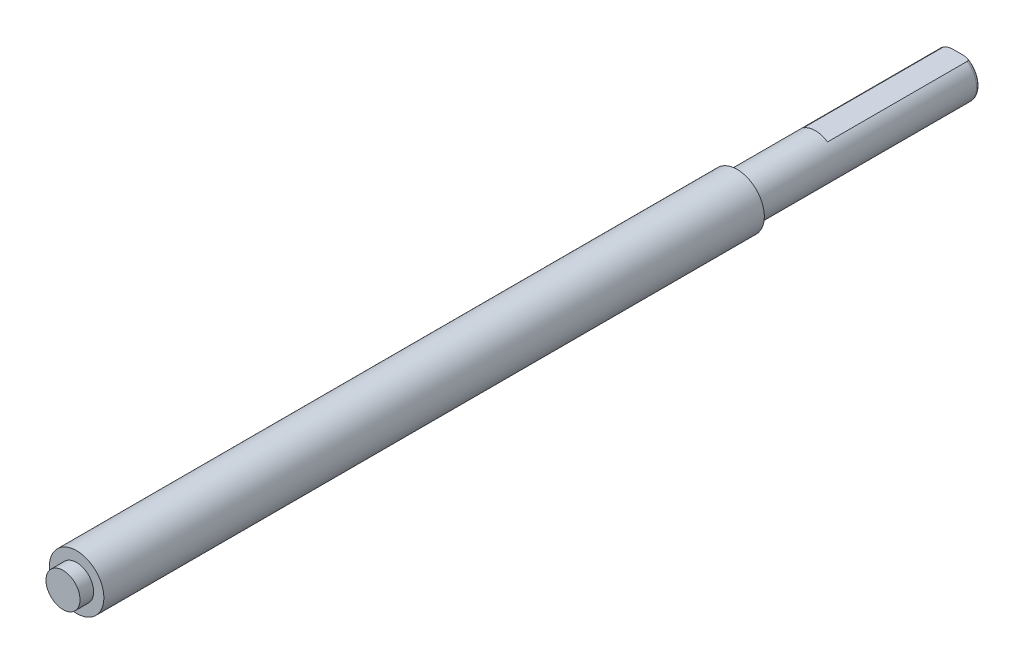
ISO-10303-21;
HEADER;
FILE_DESCRIPTION(('STEP AP214'),'2;1');
FILE_NAME('part.step','',(''),(''),'','','');
FILE_SCHEMA(('AUTOMOTIVE_DESIGN { 1 0 10303 214 1 1 1 1 }'));
ENDSEC;
DATA;
#1=APPLICATION_CONTEXT('core data for automotive mechanical design processes');
#2=APPLICATION_PROTOCOL_DEFINITION('international standard','automotive_design',2000,#1);
#3=PRODUCT_CONTEXT('',#1,'mechanical');
#4=PRODUCT('Part','Part','',(#3));
#5=PRODUCT_RELATED_PRODUCT_CATEGORY('part','',(#4));
#6=PRODUCT_DEFINITION_FORMATION('','',#4);
#7=PRODUCT_DEFINITION_CONTEXT('part definition',#1,'design');
#8=PRODUCT_DEFINITION('design','',#6,#7);
#9=PRODUCT_DEFINITION_SHAPE('','',#8);
#10=(LENGTH_UNIT() NAMED_UNIT(*) SI_UNIT(.MILLI.,.METRE.));
#11=(NAMED_UNIT(*) PLANE_ANGLE_UNIT() SI_UNIT($,.RADIAN.));
#12=(NAMED_UNIT(*) SI_UNIT($,.STERADIAN.) SOLID_ANGLE_UNIT());
#13=UNCERTAINTY_MEASURE_WITH_UNIT(LENGTH_MEASURE(1.E-05),#10,'distance_accuracy_value','');
#14=(GEOMETRIC_REPRESENTATION_CONTEXT(3) GLOBAL_UNCERTAINTY_ASSIGNED_CONTEXT((#13)) GLOBAL_UNIT_ASSIGNED_CONTEXT((#10,
#11,#12)) REPRESENTATION_CONTEXT('',''));
#15=CARTESIAN_POINT('',(0.,0.,0.));
#16=DIRECTION('',(0.,0.,1.));
#17=DIRECTION('',(1.,0.,0.));
#18=AXIS2_PLACEMENT_3D('',#15,#16,#17);
#19=CARTESIAN_POINT('',(0.,0.,129.5));
#20=DIRECTION('',(0.,0.,1.));
#21=DIRECTION('',(1.,0.,0.));
#22=AXIS2_PLACEMENT_3D('',#19,#20,#21);
#23=PLANE('',#22);
#24=CARTESIAN_POINT('',(0.,0.,129.5));
#25=DIRECTION('',(0.,0.,1.));
#26=DIRECTION('',(1.,0.,0.));
#27=AXIS2_PLACEMENT_3D('',#24,#25,#26);
#28=CIRCLE('',#27,4.);
#29=CARTESIAN_POINT('',(-4.,0.,129.5));
#30=VERTEX_POINT('',#29);
#31=EDGE_CURVE('E88',#30,#30,#28,.T.);
#32=ORIENTED_EDGE('',*,*,#31,.T.);
#33=EDGE_LOOP('',(#32));
#34=FACE_BOUND('',#33,.T.);
#35=CARTESIAN_POINT('',(0.,0.,129.5));
#36=DIRECTION('',(0.,0.,1.));
#37=DIRECTION('',(1.,0.,0.));
#38=AXIS2_PLACEMENT_3D('',#35,#36,#37);
#39=CIRCLE('',#38,2.5);
#40=CARTESIAN_POINT('',(2.5,0.,129.5));
#41=VERTEX_POINT('',#40);
#42=EDGE_CURVE('E201',#41,#41,#39,.T.);
#43=ORIENTED_EDGE('',*,*,#42,.F.);
#44=EDGE_LOOP('',(#43));
#45=FACE_BOUND('',#44,.T.);
#46=ADVANCED_FACE('F33',(#34,#45),#23,.T.);
#47=CARTESIAN_POINT('',(0.,0.,32.5));
#48=DIRECTION('',(0.,0.,-1.));
#49=DIRECTION('',(-1.,0.,0.));
#50=AXIS2_PLACEMENT_3D('',#47,#48,#49);
#51=CYLINDRICAL_SURFACE('',#50,3.175);
#52=CARTESIAN_POINT('',(0.,0.,32.5));
#53=DIRECTION('',(0.,0.,1.));
#54=DIRECTION('',(1.,0.,0.));
#55=AXIS2_PLACEMENT_3D('',#52,#53,#54);
#56=CIRCLE('',#55,3.175);
#57=CARTESIAN_POINT('',(3.175,0.,32.5));
#58=VERTEX_POINT('',#57);
#59=EDGE_CURVE('E91',#58,#58,#56,.T.);
#60=ORIENTED_EDGE('',*,*,#59,.F.);
#61=EDGE_LOOP('',(#60));
#62=FACE_BOUND('',#61,.T.);
#63=DIRECTION('',(0.,0.,-1.));
#64=VECTOR('',#63,1.);
#65=CARTESIAN_POINT('',(-1.78605710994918,2.625,21.));
#66=LINE('',#65,#64);
#67=CARTESIAN_POINT('',(-1.78605710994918,2.625,21.));
#68=VERTEX_POINT('',#67);
#69=CARTESIAN_POINT('',(-1.78605710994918,2.625,0.500000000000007));
#70=VERTEX_POINT('',#69);
#71=EDGE_CURVE('E77',#68,#70,#66,.T.);
#72=ORIENTED_EDGE('',*,*,#71,.T.);
#73=CARTESIAN_POINT('',(0.,0.,0.5));
#74=DIRECTION('',(0.,0.,1.));
#75=DIRECTION('',(1.,0.,0.));
#76=AXIS2_PLACEMENT_3D('',#73,#74,#75);
#77=CIRCLE('',#76,3.175);
#78=CARTESIAN_POINT('',(1.78605710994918,2.625,0.500000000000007));
#79=VERTEX_POINT('',#78);
#80=EDGE_CURVE('E82',#70,#79,#77,.T.);
#81=ORIENTED_EDGE('',*,*,#80,.T.);
#82=DIRECTION('',(0.,0.,-1.));
#83=VECTOR('',#82,1.);
#84=CARTESIAN_POINT('',(1.78605710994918,2.625,21.));
#85=LINE('',#84,#83);
#86=CARTESIAN_POINT('',(1.78605710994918,2.625,21.));
#87=VERTEX_POINT('',#86);
#88=EDGE_CURVE('E76',#87,#79,#85,.T.);
#89=ORIENTED_EDGE('',*,*,#88,.F.);
#90=CARTESIAN_POINT('',(0.,0.,21.));
#91=DIRECTION('',(0.,0.,-1.));
#92=DIRECTION('',(-1.,0.,0.));
#93=AXIS2_PLACEMENT_3D('',#90,#91,#92);
#94=CIRCLE('',#93,3.175);
#95=EDGE_CURVE('E66',#68,#87,#94,.T.);
#96=ORIENTED_EDGE('',*,*,#95,.F.);
#97=EDGE_LOOP('',(#72,#81,#89,#96));
#98=FACE_BOUND('',#97,.T.);
#99=ADVANCED_FACE('F80',(#62,#98),#51,.T.);
#100=CARTESIAN_POINT('',(0.,0.,0.));
#101=DIRECTION('',(0.,0.,1.));
#102=DIRECTION('',(1.,0.,0.));
#103=AXIS2_PLACEMENT_3D('',#100,#101,#102);
#104=PLANE('',#103);
#105=DIRECTION('',(-1.,0.,0.));
#106=VECTOR('',#105,1.);
#107=CARTESIAN_POINT('',(1.78605710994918,2.625,0.));
#108=LINE('',#107,#106);
#109=CARTESIAN_POINT('',(0.514781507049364,2.625,0.));
#110=VERTEX_POINT('',#109);
#111=CARTESIAN_POINT('',(-0.514781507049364,2.625,0.));
#112=VERTEX_POINT('',#111);
#113=EDGE_CURVE('E73',#110,#112,#108,.T.);
#114=ORIENTED_EDGE('',*,*,#113,.F.);
#115=CARTESIAN_POINT('',(0.,0.,0.));
#116=DIRECTION('',(0.,0.,1.));
#117=DIRECTION('',(1.,0.,0.));
#118=AXIS2_PLACEMENT_3D('',#115,#116,#117);
#119=CIRCLE('',#118,2.675);
#120=EDGE_CURVE('E11',#110,#112,#119,.F.);
#121=ORIENTED_EDGE('',*,*,#120,.T.);
#122=EDGE_LOOP('',(#114,#121));
#123=FACE_BOUND('',#122,.T.);
#124=ADVANCED_FACE('F118',(#123),#104,.F.);
#125=CARTESIAN_POINT('',(0.,0.,32.5));
#126=DIRECTION('',(0.,0.,1.));
#127=DIRECTION('',(1.,0.,0.));
#128=AXIS2_PLACEMENT_3D('',#125,#126,#127);
#129=PLANE('',#128);
#130=CARTESIAN_POINT('',(0.,0.,32.5));
#131=DIRECTION('',(0.,0.,1.));
#132=DIRECTION('',(1.,0.,0.));
#133=AXIS2_PLACEMENT_3D('',#130,#131,#132);
#134=CIRCLE('',#133,4.);
#135=CARTESIAN_POINT('',(-4.,0.,32.5));
#136=VERTEX_POINT('',#135);
#137=EDGE_CURVE('E84',#136,#136,#134,.T.);
#138=ORIENTED_EDGE('',*,*,#137,.F.);
#139=EDGE_LOOP('',(#138));
#140=FACE_BOUND('',#139,.T.);
#141=ORIENTED_EDGE('',*,*,#59,.T.);
#142=EDGE_LOOP('',(#141));
#143=FACE_BOUND('',#142,.T.);
#144=ADVANCED_FACE('F115',(#140,#143),#129,.F.);
#145=CARTESIAN_POINT('',(0.,0.,129.5));
#146=DIRECTION('',(0.,0.,-1.));
#147=DIRECTION('',(-1.,0.,0.));
#148=AXIS2_PLACEMENT_3D('',#145,#146,#147);
#149=CYLINDRICAL_SURFACE('',#148,4.);
#150=CARTESIAN_POINT('',(-4.,0.,129.5));
#151=CARTESIAN_POINT('',(-4.,0.,128.489583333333));
#152=CARTESIAN_POINT('',(-4.,0.,127.479166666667));
#153=CARTESIAN_POINT('',(-4.,0.,125.458333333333));
#154=CARTESIAN_POINT('',(-4.,0.,124.447916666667));
#155=CARTESIAN_POINT('',(-4.,0.,122.427083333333));
#156=CARTESIAN_POINT('',(-4.,0.,121.416666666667));
#157=CARTESIAN_POINT('',(-4.,0.,119.395833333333));
#158=CARTESIAN_POINT('',(-4.,0.,118.385416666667));
#159=CARTESIAN_POINT('',(-4.,0.,116.364583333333));
#160=CARTESIAN_POINT('',(-4.,0.,115.354166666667));
#161=CARTESIAN_POINT('',(-4.,0.,113.333333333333));
#162=CARTESIAN_POINT('',(-4.,0.,112.322916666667));
#163=CARTESIAN_POINT('',(-4.,0.,110.302083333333));
#164=CARTESIAN_POINT('',(-4.,0.,109.291666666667));
#165=CARTESIAN_POINT('',(-4.,0.,107.270833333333));
#166=CARTESIAN_POINT('',(-4.,0.,106.260416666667));
#167=CARTESIAN_POINT('',(-4.,0.,104.239583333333));
#168=CARTESIAN_POINT('',(-4.,0.,103.229166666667));
#169=CARTESIAN_POINT('',(-4.,0.,101.208333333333));
#170=CARTESIAN_POINT('',(-4.,0.,100.197916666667));
#171=CARTESIAN_POINT('',(-4.,0.,98.1770833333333));
#172=CARTESIAN_POINT('',(-4.,0.,97.1666666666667));
#173=CARTESIAN_POINT('',(-4.,0.,95.1458333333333));
#174=CARTESIAN_POINT('',(-4.,0.,94.1354166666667));
#175=CARTESIAN_POINT('',(-4.,0.,92.1145833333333));
#176=CARTESIAN_POINT('',(-4.,0.,91.1041666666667));
#177=CARTESIAN_POINT('',(-4.,0.,89.0833333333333));
#178=CARTESIAN_POINT('',(-4.,0.,88.0729166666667));
#179=CARTESIAN_POINT('',(-4.,0.,86.0520833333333));
#180=CARTESIAN_POINT('',(-4.,0.,85.0416666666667));
#181=CARTESIAN_POINT('',(-4.,0.,83.0208333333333));
#182=CARTESIAN_POINT('',(-4.,0.,82.0104166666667));
#183=CARTESIAN_POINT('',(-4.,0.,79.9895833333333));
#184=CARTESIAN_POINT('',(-4.,0.,78.9791666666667));
#185=CARTESIAN_POINT('',(-4.,0.,76.9583333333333));
#186=CARTESIAN_POINT('',(-4.,0.,75.9479166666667));
#187=CARTESIAN_POINT('',(-4.,0.,73.9270833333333));
#188=CARTESIAN_POINT('',(-4.,0.,72.9166666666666));
#189=CARTESIAN_POINT('',(-4.,0.,70.8958333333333));
#190=CARTESIAN_POINT('',(-4.,0.,69.8854166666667));
#191=CARTESIAN_POINT('',(-4.,0.,67.8645833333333));
#192=CARTESIAN_POINT('',(-4.,0.,66.8541666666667));
#193=CARTESIAN_POINT('',(-4.,0.,64.8333333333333));
#194=CARTESIAN_POINT('',(-4.,0.,63.8229166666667));
#195=CARTESIAN_POINT('',(-4.,0.,61.8020833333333));
#196=CARTESIAN_POINT('',(-4.,0.,60.7916666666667));
#197=CARTESIAN_POINT('',(-4.,0.,58.7708333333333));
#198=CARTESIAN_POINT('',(-4.,0.,57.7604166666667));
#199=CARTESIAN_POINT('',(-4.,0.,55.7395833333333));
#200=CARTESIAN_POINT('',(-4.,0.,54.7291666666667));
#201=CARTESIAN_POINT('',(-4.,0.,52.7083333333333));
#202=CARTESIAN_POINT('',(-4.,0.,51.6979166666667));
#203=CARTESIAN_POINT('',(-4.,0.,49.6770833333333));
#204=CARTESIAN_POINT('',(-4.,0.,48.6666666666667));
#205=CARTESIAN_POINT('',(-4.,0.,46.6458333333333));
#206=CARTESIAN_POINT('',(-4.,0.,45.6354166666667));
#207=CARTESIAN_POINT('',(-4.,0.,43.6145833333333));
#208=CARTESIAN_POINT('',(-4.,0.,42.6041666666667));
#209=CARTESIAN_POINT('',(-4.,0.,40.5833333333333));
#210=CARTESIAN_POINT('',(-4.,0.,39.5729166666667));
#211=CARTESIAN_POINT('',(-4.,0.,37.5520833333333));
#212=CARTESIAN_POINT('',(-4.,0.,36.5416666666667));
#213=CARTESIAN_POINT('',(-4.,0.,34.5208333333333));
#214=CARTESIAN_POINT('',(-4.,0.,33.5104166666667));
#215=CARTESIAN_POINT('',(-4.,0.,32.5));
#216=B_SPLINE_CURVE_WITH_KNOTS('',3,(#150,#151,#152,#153,#154,#155,#156,#157,#158,#159,#160,
#161,#162,#163,#164,#165,#166,#167,#168,#169,#170,#171,#172,#173,#174,#175,#176,#177,#178,#179,
#180,#181,#182,#183,#184,#185,#186,#187,#188,#189,#190,#191,#192,#193,#194,#195,#196,#197,#198,
#199,#200,#201,#202,#203,#204,#205,#206,#207,#208,#209,#210,#211,#212,#213,#214,#215),
.UNSPECIFIED.,.F.,.F.,(4,2,2,2,2,2,2,2,2,2,2,2,2,2,2,2,2,2,2,2,2,2,2,2,2,2,2,2,2,2,2,2,4),(0.,
3.03124999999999,6.06249999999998,9.09374999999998,12.125,15.15625,18.1875,21.21875,24.25,
27.28125,30.3125,33.34375,36.375,39.40625,42.4375,45.46875,48.5,51.53125,54.5625,57.59375,
60.625,63.65625,66.6875,69.71875,72.75,75.78125,78.8125,81.84375,84.875,87.90625,90.9375,
93.96875,97.),.UNSPECIFIED.);
#217=EDGE_CURVE('BSEAM109',#30,#136,#216,.T.);
#218=ORIENTED_EDGE('',*,*,#31,.F.);
#219=ORIENTED_EDGE('',*,*,#137,.T.);
#220=ORIENTED_EDGE('',*,*,#217,.T.);
#221=ORIENTED_EDGE('',*,*,#217,.F.);
#222=EDGE_LOOP('',(#218,#220,#219,#221));
#223=FACE_BOUND('',#222,.T.);
#224=ADVANCED_FACE('F109',(#223),#149,.T.);
#225=CARTESIAN_POINT('',(1.78605710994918,2.625,21.));
#226=DIRECTION('',(0.,-1.,0.));
#227=DIRECTION('',(0.,0.,-1.));
#228=AXIS2_PLACEMENT_3D('',#225,#226,#227);
#229=PLANE('',#228);
#230=ORIENTED_EDGE('',*,*,#88,.T.);
#231=CARTESIAN_POINT('',(1.78605710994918,2.625,0.5));
#232=CARTESIAN_POINT('',(1.7861183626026,2.625,0.480515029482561));
#233=CARTESIAN_POINT('',(1.78403706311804,2.625,0.461106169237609));
#234=CARTESIAN_POINT('',(1.77614566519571,2.625,0.423291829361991));
#235=CARTESIAN_POINT('',(1.77038040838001,2.625,0.404877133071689));
#236=CARTESIAN_POINT('',(1.75568721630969,2.625,0.369486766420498));
#237=CARTESIAN_POINT('',(1.74677356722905,2.625,0.352505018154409));
#238=CARTESIAN_POINT('',(1.72641804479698,2.625,0.320088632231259));
#239=CARTESIAN_POINT('',(1.71496821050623,2.625,0.304659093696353));
#240=CARTESIAN_POINT('',(1.68383170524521,2.625,0.26803343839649));
#241=CARTESIAN_POINT('',(1.66291485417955,2.625,0.247887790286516));
#242=CARTESIAN_POINT('',(1.61825721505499,2.625,0.211090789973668));
#243=CARTESIAN_POINT('',(1.59451232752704,2.625,0.194444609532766));
#244=CARTESIAN_POINT('',(1.52776741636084,2.625,0.153457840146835));
#245=CARTESIAN_POINT('',(1.48301267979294,2.625,0.131986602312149));
#246=CARTESIAN_POINT('',(1.41389871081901,2.625,0.104695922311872));
#247=CARTESIAN_POINT('',(1.39041958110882,2.625,0.0963921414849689));
#248=CARTESIAN_POINT('',(1.34299986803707,2.625,0.0812423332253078));
#249=CARTESIAN_POINT('',(1.31905952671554,2.625,0.074395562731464));
#250=CARTESIAN_POINT('',(1.23008070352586,2.625,0.0514093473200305));
#251=CARTESIAN_POINT('',(1.16404779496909,2.625,0.0391500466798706));
#252=CARTESIAN_POINT('',(1.03103589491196,2.625,0.0205768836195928));
#253=CARTESIAN_POINT('',(0.964054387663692,2.625,0.0142841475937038));
#254=CARTESIAN_POINT('',(0.833124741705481,2.625,0.00573297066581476));
#255=CARTESIAN_POINT('',(0.769187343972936,2.625,0.00329337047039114));
#256=CARTESIAN_POINT('',(0.67349457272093,2.625,0.0011481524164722));
#257=CARTESIAN_POINT('',(0.641749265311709,2.625,0.000684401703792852));
#258=CARTESIAN_POINT('',(0.578263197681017,2.625,0.000111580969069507));
#259=CARTESIAN_POINT('',(0.546522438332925,2.625,2.42149440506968E-06));
#260=CARTESIAN_POINT('',(0.514781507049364,2.625,0.));
#261=B_SPLINE_CURVE_WITH_KNOTS('',3,(#231,#232,#233,#234,#235,#236,#237,#238,#239,#240,#241,
#242,#243,#244,#245,#246,#247,#248,#249,#250,#251,#252,#253,#254,#255,#256,#257,#258,#259,#260),
.UNSPECIFIED.,.F.,.F.,(4,2,2,2,2,2,2,2,2,2,2,2,2,2,4),(0.,0.0582234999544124,0.115751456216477,
0.173021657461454,0.230474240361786,0.317101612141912,0.403856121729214,0.551884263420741,
0.62657755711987,0.701232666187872,0.90221485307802,1.10390604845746,1.29579765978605,
1.39104324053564,1.48626479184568),.UNSPECIFIED.);
#262=EDGE_CURVE('E42',#79,#110,#261,.T.);
#263=ORIENTED_EDGE('',*,*,#262,.T.);
#264=ORIENTED_EDGE('',*,*,#113,.T.);
#265=CARTESIAN_POINT('',(-0.514781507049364,2.625,0.));
#266=CARTESIAN_POINT('',(-0.545138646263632,2.625,1.99675866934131E-06));
#267=CARTESIAN_POINT('',(-0.575495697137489,2.625,0.00010207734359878));
#268=CARTESIAN_POINT('',(-0.63621318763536,2.625,0.000620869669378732));
#269=CARTESIAN_POINT('',(-0.666573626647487,2.625,0.00103964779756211));
#270=CARTESIAN_POINT('',(-0.757972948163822,2.625,0.00296465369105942));
#271=CARTESIAN_POINT('',(-0.819003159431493,2.625,0.00514219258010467));
#272=CARTESIAN_POINT('',(-0.941825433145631,2.625,0.0125778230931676));
#273=CARTESIAN_POINT('',(-1.00361494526,2.625,0.0178823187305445));
#274=CARTESIAN_POINT('',(-1.12651560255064,2.625,0.0332527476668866));
#275=CARTESIAN_POINT('',(-1.18762806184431,2.625,0.0433066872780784));
#276=CARTESIAN_POINT('',(-1.28243856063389,2.625,0.0645844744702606));
#277=CARTESIAN_POINT('',(-1.31665689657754,2.625,0.0734587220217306));
#278=CARTESIAN_POINT('',(-1.38423460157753,2.625,0.0940301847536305));
#279=CARTESIAN_POINT('',(-1.41759448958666,2.625,0.105725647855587));
#280=CARTESIAN_POINT('',(-1.48318231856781,2.625,0.132705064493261));
#281=CARTESIAN_POINT('',(-1.51539860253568,2.625,0.148017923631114));
#282=CARTESIAN_POINT('',(-1.57740901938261,2.625,0.182992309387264));
#283=CARTESIAN_POINT('',(-1.60720754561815,2.625,0.202645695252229));
#284=CARTESIAN_POINT('',(-1.65201841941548,2.625,0.238603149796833));
#285=CARTESIAN_POINT('',(-1.66831627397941,2.625,0.253297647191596));
#286=CARTESIAN_POINT('',(-1.69872512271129,2.625,0.28482495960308));
#287=CARTESIAN_POINT('',(-1.71283757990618,2.625,0.301656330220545));
#288=CARTESIAN_POINT('',(-1.73617877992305,2.625,0.334788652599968));
#289=CARTESIAN_POINT('',(-1.74582188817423,2.625,0.350794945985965));
#290=CARTESIAN_POINT('',(-1.76232487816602,2.625,0.38416491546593));
#291=CARTESIAN_POINT('',(-1.76919194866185,2.625,0.401524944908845));
#292=CARTESIAN_POINT('',(-1.77820439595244,2.625,0.432417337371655));
#293=CARTESIAN_POINT('',(-1.78112252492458,2.625,0.445725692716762));
#294=CARTESIAN_POINT('',(-1.78506131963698,2.625,0.472682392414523));
#295=CARTESIAN_POINT('',(-1.78607295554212,2.625,0.486332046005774));
#296=CARTESIAN_POINT('',(-1.78605710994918,2.625,0.500000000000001));
#297=B_SPLINE_CURVE_WITH_KNOTS('',3,(#265,#266,#267,#268,#269,#270,#271,#272,#273,#274,#275,
#276,#277,#278,#279,#280,#281,#282,#283,#284,#285,#286,#287,#288,#289,#290,#291,#292,#293,#294,
#295,#296),.UNSPECIFIED.,.F.,.F.,(4,2,2,2,2,2,2,2,2,2,2,2,2,2,2,4),(0.,0.091070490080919,
0.182159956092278,0.365318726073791,0.551266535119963,0.736747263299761,0.842706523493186,
0.948600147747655,1.05537040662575,1.16194209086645,1.22761113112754,1.2932360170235,
1.34908253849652,1.40478350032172,1.44552659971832,1.4864621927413),.UNSPECIFIED.);
#298=EDGE_CURVE('E97',#112,#70,#297,.T.);
#299=ORIENTED_EDGE('',*,*,#298,.T.);
#300=ORIENTED_EDGE('',*,*,#71,.F.);
#301=DIRECTION('',(-1.,0.,0.));
#302=VECTOR('',#301,1.);
#303=CARTESIAN_POINT('',(1.78605710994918,2.625,21.));
#304=LINE('',#303,#302);
#305=EDGE_CURVE('E69',#87,#68,#304,.T.);
#306=ORIENTED_EDGE('',*,*,#305,.F.);
#307=EDGE_LOOP('',(#230,#263,#264,#299,#300,#306));
#308=FACE_BOUND('',#307,.T.);
#309=ADVANCED_FACE('F75',(#308),#229,.F.);
#310=CARTESIAN_POINT('',(0.,0.,21.));
#311=DIRECTION('',(0.,0.,-1.));
#312=DIRECTION('',(-1.,0.,0.));
#313=AXIS2_PLACEMENT_3D('',#310,#311,#312);
#314=PLANE('',#313);
#315=ORIENTED_EDGE('',*,*,#95,.T.);
#316=ORIENTED_EDGE('',*,*,#305,.T.);
#317=EDGE_LOOP('',(#315,#316));
#318=FACE_BOUND('',#317,.T.);
#319=ADVANCED_FACE('F68',(#318),#314,.T.);
#320=CARTESIAN_POINT('',(0.,0.,0.5));
#321=DIRECTION('',(0.,0.,1.));
#322=DIRECTION('',(1.,0.,0.));
#323=AXIS2_PLACEMENT_3D('',#320,#321,#322);
#324=TOROIDAL_SURFACE('',#323,2.675,0.5);
#325=ORIENTED_EDGE('',*,*,#298,.F.);
#326=ORIENTED_EDGE('',*,*,#120,.F.);
#327=ORIENTED_EDGE('',*,*,#262,.F.);
#328=ORIENTED_EDGE('',*,*,#80,.F.);
#329=EDGE_LOOP('',(#325,#326,#327,#328));
#330=FACE_BOUND('',#329,.T.);
#331=ADVANCED_FACE('F35',(#330),#324,.T.);
#332=CARTESIAN_POINT('',(0.,0.,131.5));
#333=DIRECTION('',(0.,0.,-1.));
#334=DIRECTION('',(-1.,0.,0.));
#335=AXIS2_PLACEMENT_3D('',#332,#333,#334);
#336=CYLINDRICAL_SURFACE('',#335,2.5);
#337=CARTESIAN_POINT('',(0.,0.,131.5));
#338=DIRECTION('',(0.,0.,1.));
#339=DIRECTION('',(1.,0.,0.));
#340=AXIS2_PLACEMENT_3D('',#337,#338,#339);
#341=CIRCLE('',#340,2.5);
#342=CARTESIAN_POINT('',(2.5,0.,131.5));
#343=VERTEX_POINT('',#342);
#344=EDGE_CURVE('E200',#343,#343,#341,.T.);
#345=ORIENTED_EDGE('',*,*,#344,.F.);
#346=EDGE_LOOP('',(#345));
#347=FACE_BOUND('',#346,.T.);
#348=ORIENTED_EDGE('',*,*,#42,.T.);
#349=EDGE_LOOP('',(#348));
#350=FACE_BOUND('',#349,.T.);
#351=ADVANCED_FACE('F159',(#347,#350),#336,.T.);
#352=CARTESIAN_POINT('',(0.,0.,131.5));
#353=DIRECTION('',(0.,0.,1.));
#354=DIRECTION('',(1.,0.,0.));
#355=AXIS2_PLACEMENT_3D('',#352,#353,#354);
#356=PLANE('',#355);
#357=ORIENTED_EDGE('',*,*,#344,.T.);
#358=EDGE_LOOP('',(#357));
#359=FACE_BOUND('',#358,.T.);
#360=ADVANCED_FACE('F166',(#359),#356,.T.);
#361=CLOSED_SHELL('',(#46,#99,#124,#144,#224,#309,#319,#331,#351,#360));
#362=MANIFOLD_SOLID_BREP('B2',#361);
#363=ADVANCED_BREP_SHAPE_REPRESENTATION('',(#18,#362),#14);
#364=SHAPE_DEFINITION_REPRESENTATION(#9,#363);
ENDSEC;
END-ISO-10303-21;
